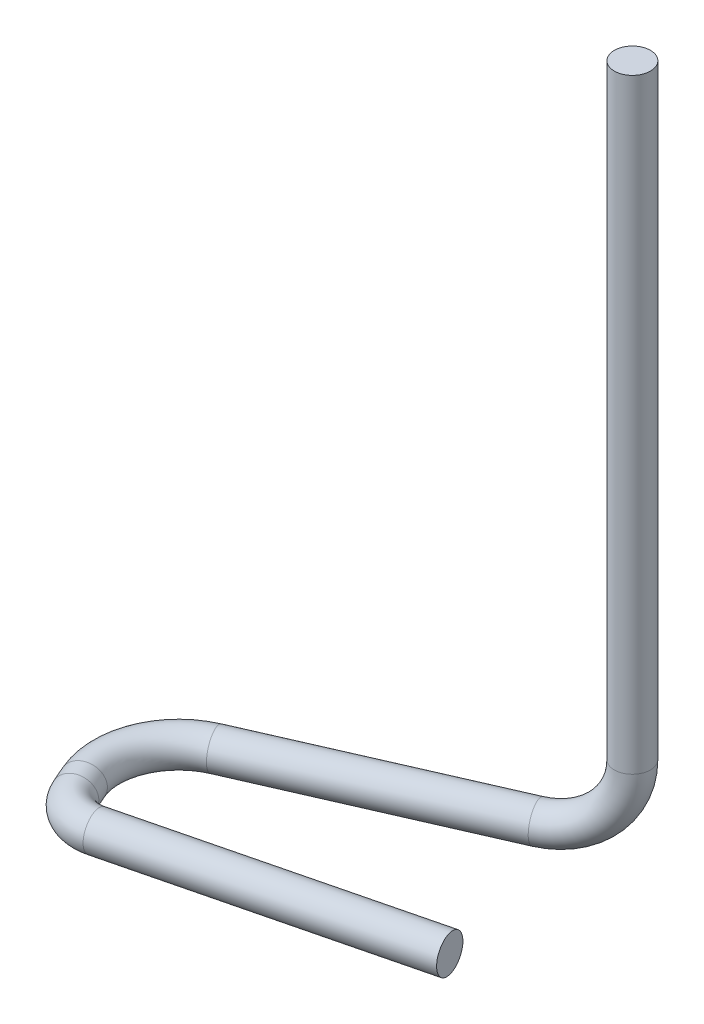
from build123d import *

# Parameters (mm, degrees)
ESQUISSE1_R = 0.25


with BuildPart() as part:
    # Balayage1: sweep along a curve in space
    with BuildLine() as balayage1_path:
        Line((4.526727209, 6, 9.116092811), (4.526727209, -2.4, 9.116092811))
        ThreePointArc((4.526727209, -2.4, 9.116092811), (4.258397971, -3.107106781, 9.233506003), (3.610593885, -3.4, 9.516966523))
        Line((3.610593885, -3.4, 9.516966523), (0.504349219, -3.4, 10.876170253))
        ThreePointArc((0.504349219, -3.4, 10.876170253), (-0.026041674, -3.4, 11.427960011), (-0.010910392, -3.4, 12.193177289))
        Line((-0.010910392, -3.4, 12.193177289), (0.082068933, -3.4, 12.405666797))
        ThreePointArc((0.082068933, -3.4, 12.405666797), (0.319190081, -3.4, 12.65376431), (0.660402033, -3.4, 12.690550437))
        Line((0.660402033, -3.4, 12.690550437), (4.592188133, -3.4, 11.716221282))
    # Esquisse1 → Balayage1 (sweep)
    with BuildSketch(Plane(origin=(4.526727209, 6, 9.116092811), x_dir=(1, 0, 0), z_dir=(8.015868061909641e-13, -1.0, 1.831991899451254e-12))):
        Circle(ESQUISSE1_R)
    sweep(path=balayage1_path.line)


solid = part.part
